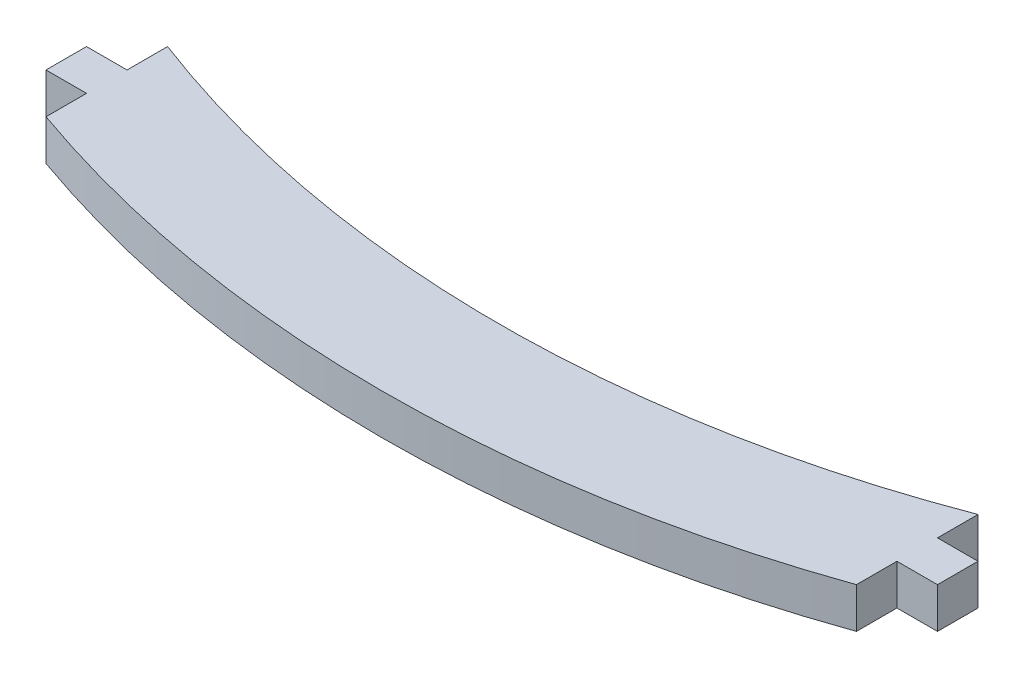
ISO-10303-21;
HEADER;
FILE_DESCRIPTION(('STEP AP214'),'2;1');
FILE_NAME('part.step','',(''),(''),'','','');
FILE_SCHEMA(('AUTOMOTIVE_DESIGN { 1 0 10303 214 1 1 1 1 }'));
ENDSEC;
DATA;
#1=APPLICATION_CONTEXT('core data for automotive mechanical design processes');
#2=APPLICATION_PROTOCOL_DEFINITION('international standard','automotive_design',2000,#1);
#3=PRODUCT_CONTEXT('',#1,'mechanical');
#4=PRODUCT('Part','Part','',(#3));
#5=PRODUCT_RELATED_PRODUCT_CATEGORY('part','',(#4));
#6=PRODUCT_DEFINITION_FORMATION('','',#4);
#7=PRODUCT_DEFINITION_CONTEXT('part definition',#1,'design');
#8=PRODUCT_DEFINITION('design','',#6,#7);
#9=PRODUCT_DEFINITION_SHAPE('','',#8);
#10=(LENGTH_UNIT() NAMED_UNIT(*) SI_UNIT(.MILLI.,.METRE.));
#11=(NAMED_UNIT(*) PLANE_ANGLE_UNIT() SI_UNIT($,.RADIAN.));
#12=(NAMED_UNIT(*) SI_UNIT($,.STERADIAN.) SOLID_ANGLE_UNIT());
#13=UNCERTAINTY_MEASURE_WITH_UNIT(LENGTH_MEASURE(1.E-05),#10,'distance_accuracy_value','');
#14=(GEOMETRIC_REPRESENTATION_CONTEXT(3) GLOBAL_UNCERTAINTY_ASSIGNED_CONTEXT((#13)) GLOBAL_UNIT_ASSIGNED_CONTEXT((#10,
#11,#12)) REPRESENTATION_CONTEXT('',''));
#15=CARTESIAN_POINT('',(0.,0.,0.));
#16=DIRECTION('',(0.,0.,1.));
#17=DIRECTION('',(1.,0.,0.));
#18=AXIS2_PLACEMENT_3D('',#15,#16,#17);
#19=CARTESIAN_POINT('',(30.,3.,-9.));
#20=DIRECTION('',(-1.,0.,0.));
#21=DIRECTION('',(0.,0.,1.));
#22=AXIS2_PLACEMENT_3D('',#19,#20,#21);
#23=PLANE('',#22);
#24=DIRECTION('',(0.,-1.,0.));
#25=VECTOR('',#24,1.);
#26=CARTESIAN_POINT('',(30.,3.,-3.));
#27=LINE('',#26,#25);
#28=CARTESIAN_POINT('',(30.,3.,-3.));
#29=VERTEX_POINT('',#28);
#30=CARTESIAN_POINT('',(30.,0.,-3.));
#31=VERTEX_POINT('',#30);
#32=EDGE_CURVE('E152',#29,#31,#27,.T.);
#33=ORIENTED_EDGE('',*,*,#32,.F.);
#34=DIRECTION('',(0.,0.,-1.));
#35=VECTOR('',#34,1.);
#36=CARTESIAN_POINT('',(30.,3.,-9.));
#37=LINE('',#36,#35);
#38=CARTESIAN_POINT('',(30.,3.,0.));
#39=VERTEX_POINT('',#38);
#40=EDGE_CURVE('E201',#39,#29,#37,.T.);
#41=ORIENTED_EDGE('',*,*,#40,.F.);
#42=DIRECTION('',(0.,-1.,0.));
#43=VECTOR('',#42,1.);
#44=CARTESIAN_POINT('',(30.,3.,0.));
#45=LINE('',#44,#43);
#46=CARTESIAN_POINT('',(30.,0.,0.));
#47=VERTEX_POINT('',#46);
#48=EDGE_CURVE('E11',#39,#47,#45,.T.);
#49=ORIENTED_EDGE('',*,*,#48,.T.);
#50=DIRECTION('',(0.,0.,-1.));
#51=VECTOR('',#50,1.);
#52=CARTESIAN_POINT('',(30.,0.,-9.));
#53=LINE('',#52,#51);
#54=EDGE_CURVE('E206',#47,#31,#53,.T.);
#55=ORIENTED_EDGE('',*,*,#54,.T.);
#56=EDGE_LOOP('',(#33,#41,#49,#55));
#57=FACE_BOUND('',#56,.T.);
#58=ADVANCED_FACE('F33',(#57),#23,.F.);
#59=CARTESIAN_POINT('',(-30.,3.,0.));
#60=DIRECTION('',(1.,0.,0.));
#61=DIRECTION('',(0.,0.,-1.));
#62=AXIS2_PLACEMENT_3D('',#59,#60,#61);
#63=PLANE('',#62);
#64=DIRECTION('',(0.,-1.,0.));
#65=VECTOR('',#64,1.);
#66=CARTESIAN_POINT('',(-30.,3.,-6.));
#67=LINE('',#66,#65);
#68=CARTESIAN_POINT('',(-30.,3.,-6.));
#69=VERTEX_POINT('',#68);
#70=CARTESIAN_POINT('',(-30.,0.,-6.));
#71=VERTEX_POINT('',#70);
#72=EDGE_CURVE('E183',#69,#71,#67,.T.);
#73=ORIENTED_EDGE('',*,*,#72,.F.);
#74=DIRECTION('',(0.,0.,1.));
#75=VECTOR('',#74,1.);
#76=CARTESIAN_POINT('',(-30.,3.,0.));
#77=LINE('',#76,#75);
#78=CARTESIAN_POINT('',(-30.,3.,-9.));
#79=VERTEX_POINT('',#78);
#80=EDGE_CURVE('E231',#79,#69,#77,.T.);
#81=ORIENTED_EDGE('',*,*,#80,.F.);
#82=DIRECTION('',(0.,-1.,0.));
#83=VECTOR('',#82,1.);
#84=CARTESIAN_POINT('',(-30.,3.,-9.));
#85=LINE('',#84,#83);
#86=CARTESIAN_POINT('',(-30.,0.,-9.));
#87=VERTEX_POINT('',#86);
#88=EDGE_CURVE('E224',#79,#87,#85,.T.);
#89=ORIENTED_EDGE('',*,*,#88,.T.);
#90=DIRECTION('',(0.,0.,1.));
#91=VECTOR('',#90,1.);
#92=CARTESIAN_POINT('',(-30.,0.,0.));
#93=LINE('',#92,#91);
#94=EDGE_CURVE('E194',#87,#71,#93,.T.);
#95=ORIENTED_EDGE('',*,*,#94,.T.);
#96=EDGE_LOOP('',(#73,#81,#89,#95));
#97=FACE_BOUND('',#96,.T.);
#98=ADVANCED_FACE('F247',(#97),#63,.F.);
#99=CARTESIAN_POINT('',(0.,3.,-84.8528137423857));
#100=DIRECTION('',(0.,-1.,0.));
#101=DIRECTION('',(0.,0.,-1.));
#102=AXIS2_PLACEMENT_3D('',#99,#100,#101);
#103=CYLINDRICAL_SURFACE('',#102,90.);
#104=CARTESIAN_POINT('',(0.,0.,-84.8528137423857));
#105=DIRECTION('',(0.,1.,0.));
#106=DIRECTION('',(0.,0.,1.));
#107=AXIS2_PLACEMENT_3D('',#104,#105,#106);
#108=CIRCLE('',#107,90.);
#109=CARTESIAN_POINT('',(-30.,0.,0.));
#110=VERTEX_POINT('',#109);
#111=EDGE_CURVE('E186',#110,#47,#108,.T.);
#112=ORIENTED_EDGE('',*,*,#111,.T.);
#113=ORIENTED_EDGE('',*,*,#48,.F.);
#114=CARTESIAN_POINT('',(0.,3.,-84.8528137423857));
#115=DIRECTION('',(0.,1.,0.));
#116=DIRECTION('',(0.,0.,1.));
#117=AXIS2_PLACEMENT_3D('',#114,#115,#116);
#118=CIRCLE('',#117,90.);
#119=CARTESIAN_POINT('',(-30.,3.,0.));
#120=VERTEX_POINT('',#119);
#121=EDGE_CURVE('E191',#120,#39,#118,.T.);
#122=ORIENTED_EDGE('',*,*,#121,.F.);
#123=DIRECTION('',(0.,-1.,0.));
#124=VECTOR('',#123,1.);
#125=CARTESIAN_POINT('',(-30.,3.,0.));
#126=LINE('',#125,#124);
#127=EDGE_CURVE('E216',#120,#110,#126,.T.);
#128=ORIENTED_EDGE('',*,*,#127,.T.);
#129=EDGE_LOOP('',(#112,#113,#122,#128));
#130=FACE_BOUND('',#129,.T.);
#131=ADVANCED_FACE('F35',(#130),#103,.T.);
#132=CARTESIAN_POINT('',(30.,3.,-6.));
#133=VERTEX_POINT('',#132);
#134=CARTESIAN_POINT('',(30.,3.,-9.00000000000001));
#135=VERTEX_POINT('',#134);
#136=EDGE_CURVE('E193',#133,#135,#37,.T.);
#137=ORIENTED_EDGE('',*,*,#136,.F.);
#138=DIRECTION('',(0.,-1.,0.));
#139=VECTOR('',#138,1.);
#140=CARTESIAN_POINT('',(30.,3.,-6.));
#141=LINE('',#140,#139);
#142=CARTESIAN_POINT('',(30.,0.,-6.));
#143=VERTEX_POINT('',#142);
#144=EDGE_CURVE('E130',#133,#143,#141,.T.);
#145=ORIENTED_EDGE('',*,*,#144,.T.);
#146=CARTESIAN_POINT('',(30.,0.,-9.00000000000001));
#147=VERTEX_POINT('',#146);
#148=EDGE_CURVE('E203',#143,#147,#53,.T.);
#149=ORIENTED_EDGE('',*,*,#148,.T.);
#150=DIRECTION('',(0.,-1.,0.));
#151=VECTOR('',#150,1.);
#152=CARTESIAN_POINT('',(30.,3.,-9.00000000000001));
#153=LINE('',#152,#151);
#154=EDGE_CURVE('E42',#135,#147,#153,.T.);
#155=ORIENTED_EDGE('',*,*,#154,.F.);
#156=EDGE_LOOP('',(#137,#145,#149,#155));
#157=FACE_BOUND('',#156,.T.);
#158=ADVANCED_FACE('F286',(#157),#23,.F.);
#159=CARTESIAN_POINT('',(0.,3.,-87.8528137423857));
#160=DIRECTION('',(0.,-1.,0.));
#161=DIRECTION('',(0.,0.,-1.));
#162=AXIS2_PLACEMENT_3D('',#159,#160,#161);
#163=CYLINDRICAL_SURFACE('',#162,84.3668550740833);
#164=CARTESIAN_POINT('',(0.,0.,-87.8528137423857));
#165=DIRECTION('',(0.,-1.,0.));
#166=DIRECTION('',(0.,0.,1.));
#167=AXIS2_PLACEMENT_3D('',#164,#165,#166);
#168=CIRCLE('',#167,84.3668550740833);
#169=EDGE_CURVE('E210',#147,#87,#168,.T.);
#170=ORIENTED_EDGE('',*,*,#169,.T.);
#171=ORIENTED_EDGE('',*,*,#88,.F.);
#172=CARTESIAN_POINT('',(0.,3.,-87.8528137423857));
#173=DIRECTION('',(0.,-1.,0.));
#174=DIRECTION('',(0.,0.,1.));
#175=AXIS2_PLACEMENT_3D('',#172,#173,#174);
#176=CIRCLE('',#175,84.3668550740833);
#177=EDGE_CURVE('E197',#135,#79,#176,.T.);
#178=ORIENTED_EDGE('',*,*,#177,.F.);
#179=ORIENTED_EDGE('',*,*,#154,.T.);
#180=EDGE_LOOP('',(#170,#171,#178,#179));
#181=FACE_BOUND('',#180,.T.);
#182=ADVANCED_FACE('F244',(#181),#163,.F.);
#183=CARTESIAN_POINT('',(-30.,3.,-3.));
#184=VERTEX_POINT('',#183);
#185=EDGE_CURVE('E171',#184,#120,#77,.T.);
#186=ORIENTED_EDGE('',*,*,#185,.F.);
#187=DIRECTION('',(0.,-1.,0.));
#188=VECTOR('',#187,1.);
#189=CARTESIAN_POINT('',(-30.,3.,-3.));
#190=LINE('',#189,#188);
#191=CARTESIAN_POINT('',(-30.,0.,-3.));
#192=VERTEX_POINT('',#191);
#193=EDGE_CURVE('E168',#184,#192,#190,.T.);
#194=ORIENTED_EDGE('',*,*,#193,.T.);
#195=EDGE_CURVE('E213',#192,#110,#93,.T.);
#196=ORIENTED_EDGE('',*,*,#195,.T.);
#197=ORIENTED_EDGE('',*,*,#127,.F.);
#198=EDGE_LOOP('',(#186,#194,#196,#197));
#199=FACE_BOUND('',#198,.T.);
#200=ADVANCED_FACE('F261',(#199),#63,.F.);
#201=CARTESIAN_POINT('',(0.,3.,-84.8528137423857));
#202=DIRECTION('',(0.,1.,0.));
#203=DIRECTION('',(0.,0.,1.));
#204=AXIS2_PLACEMENT_3D('',#201,#202,#203);
#205=PLANE('',#204);
#206=ORIENTED_EDGE('',*,*,#121,.T.);
#207=ORIENTED_EDGE('',*,*,#40,.T.);
#208=DIRECTION('',(1.,0.,0.));
#209=VECTOR('',#208,1.);
#210=CARTESIAN_POINT('',(33.,3.,-3.));
#211=LINE('',#210,#209);
#212=CARTESIAN_POINT('',(33.,3.,-3.));
#213=VERTEX_POINT('',#212);
#214=EDGE_CURVE('E133',#29,#213,#211,.T.);
#215=ORIENTED_EDGE('',*,*,#214,.T.);
#216=DIRECTION('',(0.,0.,-1.));
#217=VECTOR('',#216,1.);
#218=CARTESIAN_POINT('',(33.,3.,-6.));
#219=LINE('',#218,#217);
#220=CARTESIAN_POINT('',(33.,3.,-6.));
#221=VERTEX_POINT('',#220);
#222=EDGE_CURVE('E134',#213,#221,#219,.T.);
#223=ORIENTED_EDGE('',*,*,#222,.T.);
#224=DIRECTION('',(-1.,0.,0.));
#225=VECTOR('',#224,1.);
#226=CARTESIAN_POINT('',(33.,3.,-6.));
#227=LINE('',#226,#225);
#228=EDGE_CURVE('E124',#221,#133,#227,.T.);
#229=ORIENTED_EDGE('',*,*,#228,.T.);
#230=ORIENTED_EDGE('',*,*,#136,.T.);
#231=ORIENTED_EDGE('',*,*,#177,.T.);
#232=ORIENTED_EDGE('',*,*,#80,.T.);
#233=DIRECTION('',(-1.,0.,0.));
#234=VECTOR('',#233,1.);
#235=CARTESIAN_POINT('',(-33.,3.,-6.));
#236=LINE('',#235,#234);
#237=CARTESIAN_POINT('',(-33.,3.,-6.));
#238=VERTEX_POINT('',#237);
#239=EDGE_CURVE('E161',#69,#238,#236,.T.);
#240=ORIENTED_EDGE('',*,*,#239,.T.);
#241=DIRECTION('',(0.,0.,1.));
#242=VECTOR('',#241,1.);
#243=CARTESIAN_POINT('',(-33.,3.,-6.));
#244=LINE('',#243,#242);
#245=CARTESIAN_POINT('',(-33.,3.,-3.));
#246=VERTEX_POINT('',#245);
#247=EDGE_CURVE('E158',#238,#246,#244,.T.);
#248=ORIENTED_EDGE('',*,*,#247,.T.);
#249=DIRECTION('',(1.,0.,0.));
#250=VECTOR('',#249,1.);
#251=CARTESIAN_POINT('',(-33.,3.,-3.));
#252=LINE('',#251,#250);
#253=EDGE_CURVE('E160',#246,#184,#252,.T.);
#254=ORIENTED_EDGE('',*,*,#253,.T.);
#255=ORIENTED_EDGE('',*,*,#185,.T.);
#256=EDGE_LOOP('',(#206,#207,#215,#223,#229,#230,#231,#232,#240,#248,#254,#255));
#257=FACE_BOUND('',#256,.T.);
#258=ADVANCED_FACE('F138',(#257),#205,.T.);
#259=CARTESIAN_POINT('',(0.,0.,-84.8528137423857));
#260=DIRECTION('',(0.,1.,0.));
#261=DIRECTION('',(0.,0.,1.));
#262=AXIS2_PLACEMENT_3D('',#259,#260,#261);
#263=PLANE('',#262);
#264=ORIENTED_EDGE('',*,*,#111,.F.);
#265=ORIENTED_EDGE('',*,*,#195,.F.);
#266=DIRECTION('',(1.,0.,0.));
#267=VECTOR('',#266,1.);
#268=CARTESIAN_POINT('',(-33.,0.,-3.));
#269=LINE('',#268,#267);
#270=CARTESIAN_POINT('',(-33.,0.,-3.));
#271=VERTEX_POINT('',#270);
#272=EDGE_CURVE('E58',#271,#192,#269,.T.);
#273=ORIENTED_EDGE('',*,*,#272,.F.);
#274=DIRECTION('',(0.,0.,1.));
#275=VECTOR('',#274,1.);
#276=CARTESIAN_POINT('',(-33.,0.,-6.));
#277=LINE('',#276,#275);
#278=CARTESIAN_POINT('',(-33.,0.,-6.));
#279=VERTEX_POINT('',#278);
#280=EDGE_CURVE('E150',#279,#271,#277,.T.);
#281=ORIENTED_EDGE('',*,*,#280,.F.);
#282=DIRECTION('',(-1.,0.,0.));
#283=VECTOR('',#282,1.);
#284=CARTESIAN_POINT('',(-33.,0.,-6.));
#285=LINE('',#284,#283);
#286=EDGE_CURVE('E148',#71,#279,#285,.T.);
#287=ORIENTED_EDGE('',*,*,#286,.F.);
#288=ORIENTED_EDGE('',*,*,#94,.F.);
#289=ORIENTED_EDGE('',*,*,#169,.F.);
#290=ORIENTED_EDGE('',*,*,#148,.F.);
#291=DIRECTION('',(-1.,0.,0.));
#292=VECTOR('',#291,1.);
#293=CARTESIAN_POINT('',(33.,0.,-6.));
#294=LINE('',#293,#292);
#295=CARTESIAN_POINT('',(33.,0.,-6.));
#296=VERTEX_POINT('',#295);
#297=EDGE_CURVE('E50',#296,#143,#294,.T.);
#298=ORIENTED_EDGE('',*,*,#297,.F.);
#299=DIRECTION('',(0.,0.,-1.));
#300=VECTOR('',#299,1.);
#301=CARTESIAN_POINT('',(33.,0.,-6.));
#302=LINE('',#301,#300);
#303=CARTESIAN_POINT('',(33.,0.,-3.));
#304=VERTEX_POINT('',#303);
#305=EDGE_CURVE('E147',#304,#296,#302,.T.);
#306=ORIENTED_EDGE('',*,*,#305,.F.);
#307=DIRECTION('',(1.,0.,0.));
#308=VECTOR('',#307,1.);
#309=CARTESIAN_POINT('',(33.,0.,-3.));
#310=LINE('',#309,#308);
#311=EDGE_CURVE('E143',#31,#304,#310,.T.);
#312=ORIENTED_EDGE('',*,*,#311,.F.);
#313=ORIENTED_EDGE('',*,*,#54,.F.);
#314=EDGE_LOOP('',(#264,#265,#273,#281,#287,#288,#289,#290,#298,#306,#312,#313));
#315=FACE_BOUND('',#314,.T.);
#316=ADVANCED_FACE('F283',(#315),#263,.F.);
#317=CARTESIAN_POINT('',(-33.,3.,-6.));
#318=DIRECTION('',(0.,0.,1.));
#319=DIRECTION('',(1.,0.,0.));
#320=AXIS2_PLACEMENT_3D('',#317,#318,#319);
#321=PLANE('',#320);
#322=ORIENTED_EDGE('',*,*,#286,.T.);
#323=DIRECTION('',(0.,-1.,0.));
#324=VECTOR('',#323,1.);
#325=CARTESIAN_POINT('',(-33.,3.,-6.));
#326=LINE('',#325,#324);
#327=EDGE_CURVE('E187',#238,#279,#326,.T.);
#328=ORIENTED_EDGE('',*,*,#327,.F.);
#329=ORIENTED_EDGE('',*,*,#239,.F.);
#330=ORIENTED_EDGE('',*,*,#72,.T.);
#331=EDGE_LOOP('',(#322,#328,#329,#330));
#332=FACE_BOUND('',#331,.T.);
#333=ADVANCED_FACE('F249',(#332),#321,.F.);
#334=CARTESIAN_POINT('',(-33.,3.,-6.));
#335=DIRECTION('',(1.,0.,0.));
#336=DIRECTION('',(0.,0.,-1.));
#337=AXIS2_PLACEMENT_3D('',#334,#335,#336);
#338=PLANE('',#337);
#339=ORIENTED_EDGE('',*,*,#280,.T.);
#340=DIRECTION('',(0.,-1.,0.));
#341=VECTOR('',#340,1.);
#342=CARTESIAN_POINT('',(-33.,3.,-3.));
#343=LINE('',#342,#341);
#344=EDGE_CURVE('E165',#246,#271,#343,.T.);
#345=ORIENTED_EDGE('',*,*,#344,.F.);
#346=ORIENTED_EDGE('',*,*,#247,.F.);
#347=ORIENTED_EDGE('',*,*,#327,.T.);
#348=EDGE_LOOP('',(#339,#345,#346,#347));
#349=FACE_BOUND('',#348,.T.);
#350=ADVANCED_FACE('F256',(#349),#338,.F.);
#351=CARTESIAN_POINT('',(-33.,3.,-3.));
#352=DIRECTION('',(0.,0.,-1.));
#353=DIRECTION('',(-1.,0.,0.));
#354=AXIS2_PLACEMENT_3D('',#351,#352,#353);
#355=PLANE('',#354);
#356=ORIENTED_EDGE('',*,*,#272,.T.);
#357=ORIENTED_EDGE('',*,*,#193,.F.);
#358=ORIENTED_EDGE('',*,*,#253,.F.);
#359=ORIENTED_EDGE('',*,*,#344,.T.);
#360=EDGE_LOOP('',(#356,#357,#358,#359));
#361=FACE_BOUND('',#360,.T.);
#362=ADVANCED_FACE('F258',(#361),#355,.F.);
#363=CARTESIAN_POINT('',(33.,3.,-6.));
#364=DIRECTION('',(-1.,0.,0.));
#365=DIRECTION('',(0.,0.,1.));
#366=AXIS2_PLACEMENT_3D('',#363,#364,#365);
#367=PLANE('',#366);
#368=ORIENTED_EDGE('',*,*,#305,.T.);
#369=DIRECTION('',(0.,-1.,0.));
#370=VECTOR('',#369,1.);
#371=CARTESIAN_POINT('',(33.,3.,-6.));
#372=LINE('',#371,#370);
#373=EDGE_CURVE('E128',#221,#296,#372,.T.);
#374=ORIENTED_EDGE('',*,*,#373,.F.);
#375=ORIENTED_EDGE('',*,*,#222,.F.);
#376=DIRECTION('',(0.,-1.,0.));
#377=VECTOR('',#376,1.);
#378=CARTESIAN_POINT('',(33.,3.,-3.));
#379=LINE('',#378,#377);
#380=EDGE_CURVE('E268',#213,#304,#379,.T.);
#381=ORIENTED_EDGE('',*,*,#380,.T.);
#382=EDGE_LOOP('',(#368,#374,#375,#381));
#383=FACE_BOUND('',#382,.T.);
#384=ADVANCED_FACE('F145',(#383),#367,.F.);
#385=CARTESIAN_POINT('',(33.,3.,-6.));
#386=DIRECTION('',(0.,0.,1.));
#387=DIRECTION('',(1.,0.,0.));
#388=AXIS2_PLACEMENT_3D('',#385,#386,#387);
#389=PLANE('',#388);
#390=ORIENTED_EDGE('',*,*,#297,.T.);
#391=ORIENTED_EDGE('',*,*,#144,.F.);
#392=ORIENTED_EDGE('',*,*,#228,.F.);
#393=ORIENTED_EDGE('',*,*,#373,.T.);
#394=EDGE_LOOP('',(#390,#391,#392,#393));
#395=FACE_BOUND('',#394,.T.);
#396=ADVANCED_FACE('F126',(#395),#389,.F.);
#397=CARTESIAN_POINT('',(33.,3.,-3.));
#398=DIRECTION('',(0.,0.,-1.));
#399=DIRECTION('',(-1.,0.,0.));
#400=AXIS2_PLACEMENT_3D('',#397,#398,#399);
#401=PLANE('',#400);
#402=ORIENTED_EDGE('',*,*,#311,.T.);
#403=ORIENTED_EDGE('',*,*,#380,.F.);
#404=ORIENTED_EDGE('',*,*,#214,.F.);
#405=ORIENTED_EDGE('',*,*,#32,.T.);
#406=EDGE_LOOP('',(#402,#403,#404,#405));
#407=FACE_BOUND('',#406,.T.);
#408=ADVANCED_FACE('F281',(#407),#401,.F.);
#409=CLOSED_SHELL('',(#58,#98,#131,#158,#182,#200,#258,#316,#333,#350,#362,#384,#396,#408));
#410=MANIFOLD_SOLID_BREP('B2',#409);
#411=ADVANCED_BREP_SHAPE_REPRESENTATION('',(#18,#410),#14);
#412=SHAPE_DEFINITION_REPRESENTATION(#9,#411);
ENDSEC;
END-ISO-10303-21;
